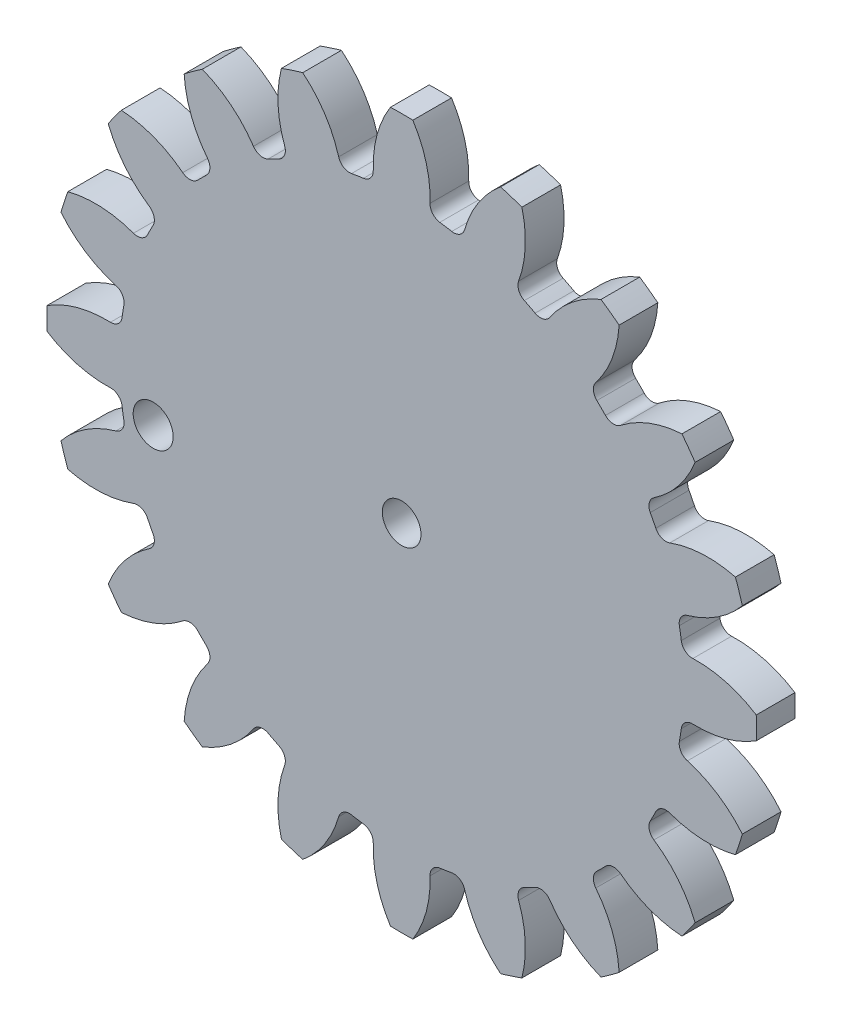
from build123d import *

# Parameters (mm, degrees)
BOSS_EXTRU_1_DEPTH                 = 6
CONG_1_R                           = 1.75
R_P_TITION_CIRCULAIRE4_COUNT       = 20
CONG_1_OF_R_P_TITION_CIRCULAIRE4_R = 1.75
ESQUISSE6_R                        = 3
ENL_V_MAT_EXTRU_1_DEPTH            = 10
ESQUISSE8_R                        = 3.1
ENL_V_MAT_EXTRU_3_DEPTH            = 79.012819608


with BuildPart() as part:
    # Esquisse3 → Boss.-Extru.1 (new body)
    with BuildSketch(Plane.XY):
        with BuildLine():
            Line((-6.844007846, 43.211364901), (0, 0))
            Line((0, 0), (6.844007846, 43.211364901))
            ThreePointArc((6.844007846, 43.211364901), (5.558296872, 43.395481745), (4.267687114, 43.541352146))
            ThreePointArc((4.267687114, 43.541352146), (4.008250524, 49.47966893), (1.736911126, 54.972567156))
            ThreePointArc((1.736911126, 54.972567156), (0, 55), (-1.736911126, 54.972567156))
            ThreePointArc((-1.736911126, 54.972567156), (-4.008250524, 49.47966893), (-4.267687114, 43.541352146))
            ThreePointArc((-4.267687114, 43.541352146), (-5.558296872, 43.395481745), (-6.844007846, 43.211364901))
        make_face()
    boss_extru_1 = extrude(amount=BOSS_EXTRU_1_DEPTH)

    # Cong_1
    cong_1_edges = [part.edges().sort_by_distance(p)[0] for p in [
        (-4.267687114, 43.541352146, 3),
        (4.267687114, 43.541352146, 3),
    ]]
    fillet(cong_1_edges, radius=CONG_1_R)

    # R_p_tition circulaire4: Boss.-Extru.1 ×20 about axis
    r_p_tition_circulaire4_axis = Axis((0, 0, 0), (0, 0, 1))
    for i in range(1, R_P_TITION_CIRCULAIRE4_COUNT):
        add(boss_extru_1.rotate(r_p_tition_circulaire4_axis, i * 360 / R_P_TITION_CIRCULAIRE4_COUNT))

    # Cong_1 of R_p_tition circulaire4
    cong_1_of_r_p_tition_circulaire4_edges = [part.edges().sort_by_distance(p)[0] for p in [
        (-17.513829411, 40.091498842, 3),
        (-9.396206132, 42.729074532, 3),
        (-29.045596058, 32.717210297, 3),
        (-22.140333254, 37.734177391, 3),
        (-37.734177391, 22.140333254, 3),
        (-32.717210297, 29.045596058, 3),
        (-42.729074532, 9.396206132, 3),
        (-40.091498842, 17.513829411, 3),
        (-43.541352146, -4.267687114, 3),
        (-43.541352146, 4.267687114, 3),
        (-40.091498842, -17.513829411, 3),
        (-42.729074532, -9.396206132, 3),
        (-32.717210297, -29.045596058, 3),
        (-37.734177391, -22.140333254, 3),
        (-22.140333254, -37.734177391, 3),
        (-29.045596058, -32.717210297, 3),
        (-9.396206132, -42.729074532, 3),
        (-17.513829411, -40.091498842, 3),
        (4.267687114, -43.541352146, 3),
        (-4.267687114, -43.541352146, 3),
        (17.513829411, -40.091498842, 3),
        (9.396206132, -42.729074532, 3),
        (29.045596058, -32.717210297, 3),
        (22.140333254, -37.734177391, 3),
        (37.734177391, -22.140333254, 3),
        (32.717210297, -29.045596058, 3),
        (42.729074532, -9.396206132, 3),
        (40.091498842, -17.513829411, 3),
        (43.541352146, 4.267687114, 3),
        (43.541352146, -4.267687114, 3),
        (40.091498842, 17.513829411, 3),
        (42.729074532, 9.396206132, 3),
        (32.717210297, 29.045596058, 3),
        (37.734177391, 22.140333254, 3),
        (22.140333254, 37.734177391, 3),
        (29.045596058, 32.717210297, 3),
        (9.396206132, 42.729074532, 3),
        (17.513829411, 40.091498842, 3),
    ]]
    fillet(cong_1_of_r_p_tition_circulaire4_edges, radius=CONG_1_OF_R_P_TITION_CIRCULAIRE4_R)

    # Esquisse6 → Enl_v. mat.-Extru.1 (cut)
    with BuildSketch(Plane.XY.offset(6)):
        Circle(ESQUISSE6_R)
    extrude(amount=-ENL_V_MAT_EXTRU_1_DEPTH, mode=Mode.SUBTRACT)

    # Esquisse8 → Enl_v. mat.-Extru.3 (cut, through all)
    with BuildSketch(Plane.XY.offset(6)):
        with Locations((-38.519845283, -6.100944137)):
            Circle(ESQUISSE8_R)
    extrude(amount=-ENL_V_MAT_EXTRU_3_DEPTH, mode=Mode.SUBTRACT)


solid = part.part
